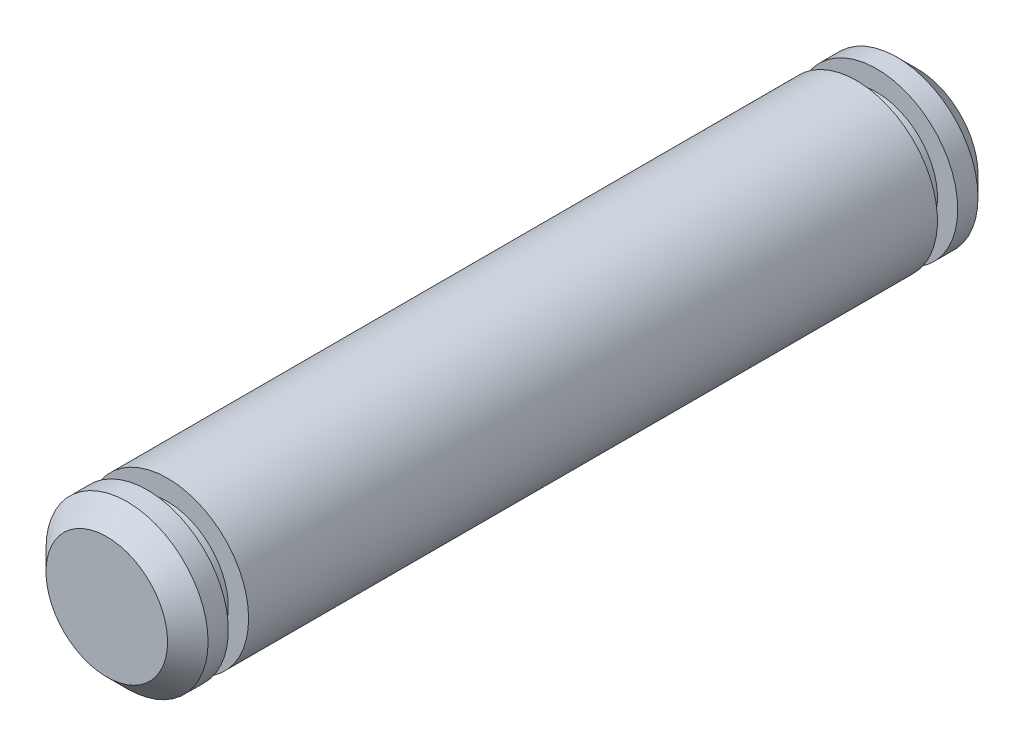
from build123d import *

# Parameters (mm, degrees)
ESQUISSE1_R          = 4
BASE_EXTRUSION_DEPTH = 40
ESQUISSE2_W          = 5
ESQUISSE2_H          = 1
ESQUISSE3_W          = 5
ESQUISSE3_H          = 1
CHANFREIN1_SIZE      = 1


with BuildPart() as part:
    # Esquisse1 → Base-Extrusion (new body)
    with BuildSketch(Plane.XY):
        with Locations(Location((0, 0, 0), (0, 0, 180))):
            Circle(ESQUISSE1_R)
    extrude(amount=BASE_EXTRUSION_DEPTH)

    # Esquisse2 → Enlever de la mati_re-Pivoter1 (revolve, cut)
    with BuildSketch(Plane(origin=(0, 0, 0), x_dir=(1, 0, 0), z_dir=(0, 1, 0))):
        with Locations((-5.5, -2.5)):
            Rectangle(ESQUISSE2_W, ESQUISSE2_H)
    revolve(axis=Axis((0, 0, -3.393664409), (0, 0, 1)), mode=Mode.SUBTRACT)

    # Esquisse3 → Enlever de la mati_re-Pivoter2 (revolve, cut)
    with BuildSketch(Plane(origin=(0, 0, 0), x_dir=(1, 0, 0), z_dir=(0, 1, 0))):
        with Locations((-5.5, -37.5)):
            Rectangle(ESQUISSE3_W, ESQUISSE3_H)
    revolve(axis=Axis((0, 0, -3.579328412), (0, 0, 1)), mode=Mode.SUBTRACT)

    # Chanfrein1
    chanfrein1_edges = [part.edges().sort_by_distance(p)[0] for p in [
        (4, 0, 0),
        (4, 0, 40),
    ]]
    chamfer(chanfrein1_edges, length=CHANFREIN1_SIZE)


solid = part.part
